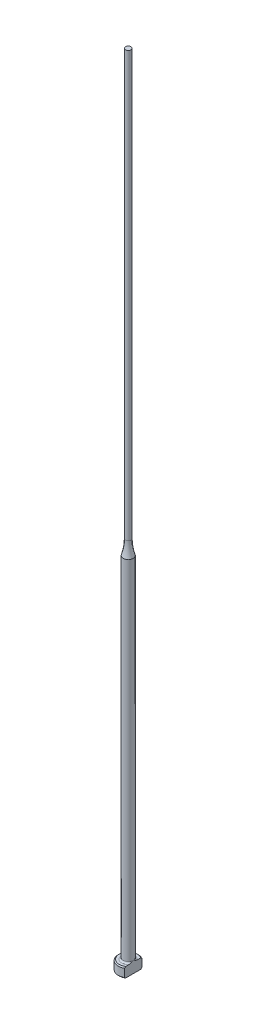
from build123d import *
from build123d.topology import SkipClean

# Parameters (mm, degrees)
CHAMFER1_SIZE = 0.2
FILLET1_R     = 0.3
KEY_DEPTH     = 161.024998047


with BuildPart() as part:
    # Sketch1 → Revolve1 (revolve)
    with BuildSketch(Plane.XY, mode=Mode.PRIVATE) as revolve1_sk:
        with BuildLine():
            Line((0, 0), (-2, 0))
            Line((-2, 0), (-2, 2))
            Line((-2, 2), (-1, 2))
            Line((-1, 2), (-1, 72.03394201))
            ThreePointArc((-1, 72.03394201), (-0.663140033, 73.5), (-0.55, 75))
            Line((-0.55, 75), (-0.55, 160))
            Line((-0.55, 160), (0, 160))
            Line((0, 160), (0, 0))
        make_face()
    revolve(revolve1_sk.sketch.rotate(Axis((0, 259.958771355, 0), (0, -1, 0)), 270), axis=Axis((0, 259.958771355, 0), (0, -1, 0)))

    # Chamfer1
    chamfer1_edges = [part.edges().sort_by_distance(p)[0] for p in [
        (0, 0, -2),
        (0, 2, -2),
    ]]
    chamfer(chamfer1_edges, length=CHAMFER1_SIZE)

    # Fillet1
    fillet1_edges = [part.edges().sort_by_distance(p)[0] for p in [
        (0, 2, -1),
    ]]
    fillet(fillet1_edges, radius=FILLET1_R)

    # Sketch2 → KEY (cut, through all)
    with SkipClean():  # the faces are left unmerged after this step: merging them gives an invalid solid
        with BuildSketch(Plane(origin=(0, 0, 0), x_dir=(1, 0, 0), z_dir=(0, 1, 0))):
            with BuildLine():
                Line((1, 1.732050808), (1, -1.732050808))
                ThreePointArc((1, -1.732050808), (2, 0), (1, 1.732050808))
            make_face()
        extrude(amount=KEY_DEPTH, mode=Mode.SUBTRACT)


solid = part.part
